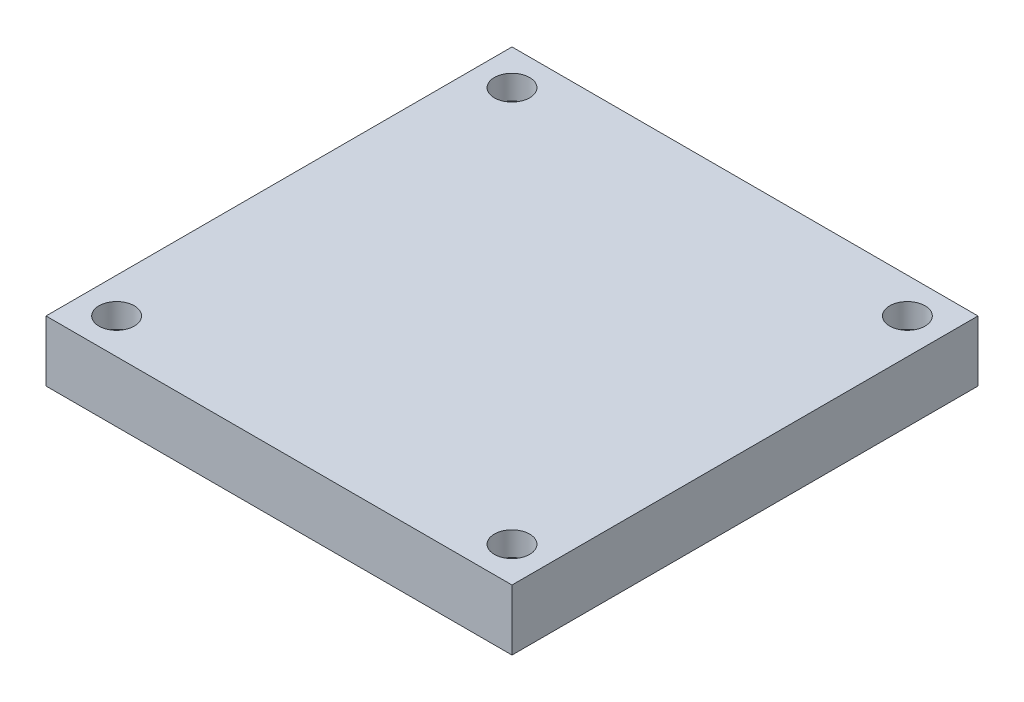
from build123d import *

# Parameters (mm, degrees)
SKETCH_1_W                  = 33
SKETCH_1_H                  = 33
EXTRUDE_1_DEPTH             = 4.3
HOLE_WIZARD_M21_D           = 2.5
HOLE_WIZARD_M21_CBORE_D     = 4.2
HOLE_WIZARD_M21_CBORE_DEPTH = 2.6


with BuildPart() as part:
    # Sketch 1 → Extrude 1 (new body)
    with BuildSketch(Plane(origin=(0, 0, 0), x_dir=(1, 0, 0), z_dir=(0, 1, 0))):
        with Locations((16.5, -16.5)):
            Rectangle(SKETCH_1_W, SKETCH_1_H)
    extrude(amount=EXTRUDE_1_DEPTH)

    # Hole Wizard M21 (through all)
    with Locations(Plane(origin=(-0.111439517, 0, -4.881758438), x_dir=(-1, 0, 0), z_dir=(0, -1, 0))):
        with Locations((-30.611439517, -35.381758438), (-2.611439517, -35.381758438), (-2.611439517, -7.381758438), (-30.611439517, -7.381758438)):
            CounterBoreHole(HOLE_WIZARD_M21_D / 2, HOLE_WIZARD_M21_CBORE_D / 2, HOLE_WIZARD_M21_CBORE_DEPTH)


solid = part.part
